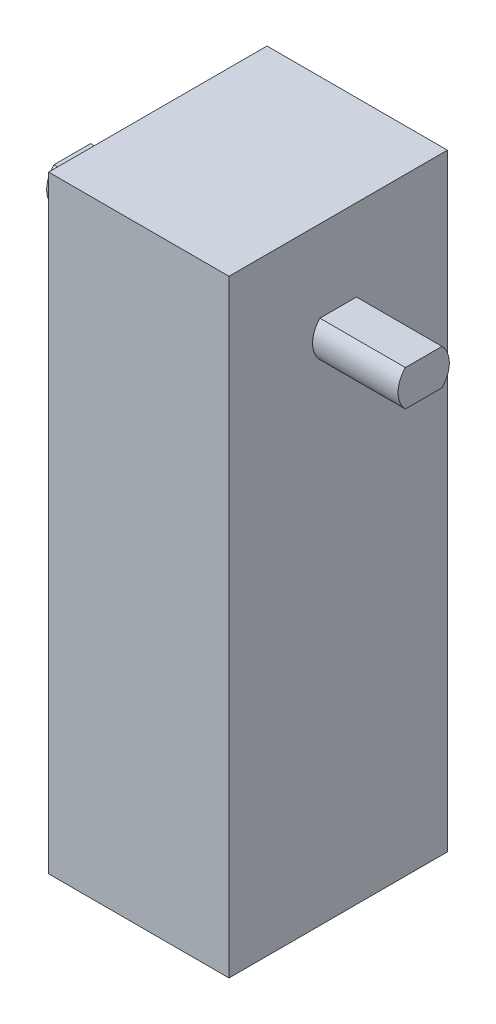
ISO-10303-21;
HEADER;
FILE_DESCRIPTION(('STEP AP214'),'2;1');
FILE_NAME('part.step','',(''),(''),'','','');
FILE_SCHEMA(('AUTOMOTIVE_DESIGN { 1 0 10303 214 1 1 1 1 }'));
ENDSEC;
DATA;
#1=APPLICATION_CONTEXT('core data for automotive mechanical design processes');
#2=APPLICATION_PROTOCOL_DEFINITION('international standard','automotive_design',2000,#1);
#3=PRODUCT_CONTEXT('',#1,'mechanical');
#4=PRODUCT('Part','Part','',(#3));
#5=PRODUCT_RELATED_PRODUCT_CATEGORY('part','',(#4));
#6=PRODUCT_DEFINITION_FORMATION('','',#4);
#7=PRODUCT_DEFINITION_CONTEXT('part definition',#1,'design');
#8=PRODUCT_DEFINITION('design','',#6,#7);
#9=PRODUCT_DEFINITION_SHAPE('','',#8);
#10=(LENGTH_UNIT() NAMED_UNIT(*) SI_UNIT(.MILLI.,.METRE.));
#11=(NAMED_UNIT(*) PLANE_ANGLE_UNIT() SI_UNIT($,.RADIAN.));
#12=(NAMED_UNIT(*) SI_UNIT($,.STERADIAN.) SOLID_ANGLE_UNIT());
#13=UNCERTAINTY_MEASURE_WITH_UNIT(LENGTH_MEASURE(1.E-05),#10,'distance_accuracy_value','');
#14=(GEOMETRIC_REPRESENTATION_CONTEXT(3) GLOBAL_UNCERTAINTY_ASSIGNED_CONTEXT((#13)) GLOBAL_UNIT_ASSIGNED_CONTEXT((#10,
#11,#12)) REPRESENTATION_CONTEXT('',''));
#15=CARTESIAN_POINT('',(0.,0.,0.));
#16=DIRECTION('',(0.,0.,1.));
#17=DIRECTION('',(1.,0.,0.));
#18=AXIS2_PLACEMENT_3D('',#15,#16,#17);
#19=CARTESIAN_POINT('',(9.29194959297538,-36.9105557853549,23.));
#20=DIRECTION('',(-1.,0.,0.));
#21=DIRECTION('',(0.,0.,1.));
#22=AXIS2_PLACEMENT_3D('',#19,#20,#21);
#23=PLANE('',#22);
#24=DIRECTION('',(0.,1.,0.));
#25=VECTOR('',#24,1.);
#26=CARTESIAN_POINT('',(9.29194959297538,-36.9105557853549,0.));
#27=LINE('',#26,#25);
#28=CARTESIAN_POINT('',(9.29194959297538,-36.9105557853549,0.));
#29=VERTEX_POINT('',#28);
#30=CARTESIAN_POINT('',(9.29194959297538,27.0894442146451,0.));
#31=VERTEX_POINT('',#30);
#32=EDGE_CURVE('E207',#29,#31,#27,.T.);
#33=ORIENTED_EDGE('',*,*,#32,.T.);
#34=DIRECTION('',(0.,0.,-1.));
#35=VECTOR('',#34,1.);
#36=CARTESIAN_POINT('',(9.29194959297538,27.0894442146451,23.));
#37=LINE('',#36,#35);
#38=CARTESIAN_POINT('',(9.29194959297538,27.0894442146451,23.));
#39=VERTEX_POINT('',#38);
#40=EDGE_CURVE('E212',#39,#31,#37,.T.);
#41=ORIENTED_EDGE('',*,*,#40,.F.);
#42=DIRECTION('',(0.,1.,0.));
#43=VECTOR('',#42,1.);
#44=CARTESIAN_POINT('',(9.29194959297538,-36.9105557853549,23.));
#45=LINE('',#44,#43);
#46=CARTESIAN_POINT('',(9.29194959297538,-36.9105557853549,23.));
#47=VERTEX_POINT('',#46);
#48=EDGE_CURVE('E198',#47,#39,#45,.T.);
#49=ORIENTED_EDGE('',*,*,#48,.F.);
#50=DIRECTION('',(0.,0.,-1.));
#51=VECTOR('',#50,1.);
#52=CARTESIAN_POINT('',(9.29194959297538,-36.9105557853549,23.));
#53=LINE('',#52,#51);
#54=EDGE_CURVE('E40',#47,#29,#53,.T.);
#55=ORIENTED_EDGE('',*,*,#54,.T.);
#56=EDGE_LOOP('',(#33,#41,#49,#55));
#57=FACE_BOUND('',#56,.T.);
#58=CARTESIAN_POINT('',(9.29194959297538,16.5894442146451,11.5));
#59=DIRECTION('',(1.,0.,0.));
#60=DIRECTION('',(0.,0.,-1.));
#61=AXIS2_PLACEMENT_3D('',#58,#59,#60);
#62=CIRCLE('',#61,2.7);
#63=CARTESIAN_POINT('',(9.29194959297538,14.6994442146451,9.57181432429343));
#64=VERTEX_POINT('',#63);
#65=CARTESIAN_POINT('',(9.29194959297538,18.4794442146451,9.57181432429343));
#66=VERTEX_POINT('',#65);
#67=EDGE_CURVE('E161',#64,#66,#62,.T.);
#68=ORIENTED_EDGE('',*,*,#67,.F.);
#69=DIRECTION('',(0.,0.,-1.));
#70=VECTOR('',#69,1.);
#71=CARTESIAN_POINT('',(9.29194959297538,14.6994442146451,13.4281856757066));
#72=LINE('',#71,#70);
#73=CARTESIAN_POINT('',(9.29194959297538,14.6994442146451,13.4281856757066));
#74=VERTEX_POINT('',#73);
#75=EDGE_CURVE('E166',#74,#64,#72,.T.);
#76=ORIENTED_EDGE('',*,*,#75,.F.);
#77=CARTESIAN_POINT('',(9.29194959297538,16.5894442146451,11.5));
#78=DIRECTION('',(1.,0.,0.));
#79=DIRECTION('',(0.,0.,-1.));
#80=AXIS2_PLACEMENT_3D('',#77,#78,#79);
#81=CIRCLE('',#80,2.7);
#82=CARTESIAN_POINT('',(9.29194959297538,18.4794442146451,13.4281856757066));
#83=VERTEX_POINT('',#82);
#84=EDGE_CURVE('E176',#83,#74,#81,.T.);
#85=ORIENTED_EDGE('',*,*,#84,.F.);
#86=DIRECTION('',(0.,0.,1.));
#87=VECTOR('',#86,1.);
#88=CARTESIAN_POINT('',(9.29194959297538,18.4794442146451,13.4281856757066));
#89=LINE('',#88,#87);
#90=EDGE_CURVE('E55',#66,#83,#89,.T.);
#91=ORIENTED_EDGE('',*,*,#90,.F.);
#92=EDGE_LOOP('',(#68,#76,#85,#91));
#93=FACE_BOUND('',#92,.T.);
#94=ADVANCED_FACE('F32',(#57,#93),#23,.F.);
#95=CARTESIAN_POINT('',(-9.70805040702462,-36.9105557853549,23.));
#96=DIRECTION('',(1.,0.,0.));
#97=DIRECTION('',(0.,1.,0.));
#98=AXIS2_PLACEMENT_3D('',#95,#96,#97);
#99=PLANE('',#98);
#100=DIRECTION('',(0.,0.,-1.));
#101=VECTOR('',#100,1.);
#102=CARTESIAN_POINT('',(-9.70805040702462,14.6994442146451,23.));
#103=LINE('',#102,#101);
#104=CARTESIAN_POINT('',(-9.70805040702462,14.6994442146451,13.4281856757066));
#105=VERTEX_POINT('',#104);
#106=CARTESIAN_POINT('',(-9.70805040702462,14.6994442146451,9.57181432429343));
#107=VERTEX_POINT('',#106);
#108=EDGE_CURVE('E156',#105,#107,#103,.T.);
#109=ORIENTED_EDGE('',*,*,#108,.T.);
#110=CARTESIAN_POINT('',(-9.70805040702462,16.5894442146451,11.5));
#111=DIRECTION('',(1.,0.,0.));
#112=DIRECTION('',(0.,1.,0.));
#113=AXIS2_PLACEMENT_3D('',#110,#111,#112);
#114=CIRCLE('',#113,2.7);
#115=CARTESIAN_POINT('',(-9.70805040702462,18.4794442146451,9.57181432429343));
#116=VERTEX_POINT('',#115);
#117=EDGE_CURVE('E159',#107,#116,#114,.T.);
#118=ORIENTED_EDGE('',*,*,#117,.T.);
#119=DIRECTION('',(0.,0.,1.));
#120=VECTOR('',#119,1.);
#121=CARTESIAN_POINT('',(-9.70805040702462,18.4794442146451,23.));
#122=LINE('',#121,#120);
#123=CARTESIAN_POINT('',(-9.70805040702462,18.4794442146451,13.4281856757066));
#124=VERTEX_POINT('',#123);
#125=EDGE_CURVE('E124',#116,#124,#122,.T.);
#126=ORIENTED_EDGE('',*,*,#125,.T.);
#127=CARTESIAN_POINT('',(-9.70805040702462,16.5894442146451,11.5));
#128=DIRECTION('',(1.,0.,0.));
#129=DIRECTION('',(0.,1.,0.));
#130=AXIS2_PLACEMENT_3D('',#127,#128,#129);
#131=CIRCLE('',#130,2.7);
#132=EDGE_CURVE('E153',#124,#105,#131,.T.);
#133=ORIENTED_EDGE('',*,*,#132,.T.);
#134=EDGE_LOOP('',(#109,#118,#126,#133));
#135=FACE_BOUND('',#134,.T.);
#136=DIRECTION('',(0.,-1.,0.));
#137=VECTOR('',#136,1.);
#138=CARTESIAN_POINT('',(-9.70805040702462,-36.9105557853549,0.));
#139=LINE('',#138,#137);
#140=CARTESIAN_POINT('',(-9.70805040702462,27.0894442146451,0.));
#141=VERTEX_POINT('',#140);
#142=CARTESIAN_POINT('',(-9.70805040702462,-36.9105557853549,0.));
#143=VERTEX_POINT('',#142);
#144=EDGE_CURVE('E191',#141,#143,#139,.T.);
#145=ORIENTED_EDGE('',*,*,#144,.T.);
#146=DIRECTION('',(0.,0.,-1.));
#147=VECTOR('',#146,1.);
#148=CARTESIAN_POINT('',(-9.70805040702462,-36.9105557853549,23.));
#149=LINE('',#148,#147);
#150=CARTESIAN_POINT('',(-9.70805040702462,-36.9105557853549,23.));
#151=VERTEX_POINT('',#150);
#152=EDGE_CURVE('E11',#151,#143,#149,.T.);
#153=ORIENTED_EDGE('',*,*,#152,.F.);
#154=DIRECTION('',(0.,-1.,0.));
#155=VECTOR('',#154,1.);
#156=CARTESIAN_POINT('',(-9.70805040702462,-36.9105557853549,23.));
#157=LINE('',#156,#155);
#158=CARTESIAN_POINT('',(-9.70805040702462,27.0894442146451,23.));
#159=VERTEX_POINT('',#158);
#160=EDGE_CURVE('E192',#159,#151,#157,.T.);
#161=ORIENTED_EDGE('',*,*,#160,.F.);
#162=DIRECTION('',(0.,0.,-1.));
#163=VECTOR('',#162,1.);
#164=CARTESIAN_POINT('',(-9.70805040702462,27.0894442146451,23.));
#165=LINE('',#164,#163);
#166=EDGE_CURVE('E202',#159,#141,#165,.T.);
#167=ORIENTED_EDGE('',*,*,#166,.T.);
#168=EDGE_LOOP('',(#145,#153,#161,#167));
#169=FACE_BOUND('',#168,.T.);
#170=ADVANCED_FACE('F34',(#135,#169),#99,.F.);
#171=CARTESIAN_POINT('',(-9.70805040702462,-36.9105557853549,23.));
#172=DIRECTION('',(0.,1.,0.));
#173=DIRECTION('',(0.,0.,1.));
#174=AXIS2_PLACEMENT_3D('',#171,#172,#173);
#175=PLANE('',#174);
#176=DIRECTION('',(1.,0.,0.));
#177=VECTOR('',#176,1.);
#178=CARTESIAN_POINT('',(-9.70805040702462,-36.9105557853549,0.));
#179=LINE('',#178,#177);
#180=EDGE_CURVE('E205',#143,#29,#179,.T.);
#181=ORIENTED_EDGE('',*,*,#180,.T.);
#182=ORIENTED_EDGE('',*,*,#54,.F.);
#183=DIRECTION('',(1.,0.,0.));
#184=VECTOR('',#183,1.);
#185=CARTESIAN_POINT('',(-9.70805040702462,-36.9105557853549,23.));
#186=LINE('',#185,#184);
#187=EDGE_CURVE('E195',#151,#47,#186,.T.);
#188=ORIENTED_EDGE('',*,*,#187,.F.);
#189=ORIENTED_EDGE('',*,*,#152,.T.);
#190=EDGE_LOOP('',(#181,#182,#188,#189));
#191=FACE_BOUND('',#190,.T.);
#192=ADVANCED_FACE('F234',(#191),#175,.F.);
#193=CARTESIAN_POINT('',(-9.70805040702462,27.0894442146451,23.));
#194=DIRECTION('',(0.,-1.,0.));
#195=DIRECTION('',(0.,0.,-1.));
#196=AXIS2_PLACEMENT_3D('',#193,#194,#195);
#197=PLANE('',#196);
#198=DIRECTION('',(-1.,0.,0.));
#199=VECTOR('',#198,1.);
#200=CARTESIAN_POINT('',(-9.70805040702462,27.0894442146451,0.));
#201=LINE('',#200,#199);
#202=EDGE_CURVE('E196',#31,#141,#201,.T.);
#203=ORIENTED_EDGE('',*,*,#202,.T.);
#204=ORIENTED_EDGE('',*,*,#166,.F.);
#205=DIRECTION('',(-1.,0.,0.));
#206=VECTOR('',#205,1.);
#207=CARTESIAN_POINT('',(-9.70805040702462,27.0894442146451,23.));
#208=LINE('',#207,#206);
#209=EDGE_CURVE('E200',#39,#159,#208,.T.);
#210=ORIENTED_EDGE('',*,*,#209,.F.);
#211=ORIENTED_EDGE('',*,*,#40,.T.);
#212=EDGE_LOOP('',(#203,#204,#210,#211));
#213=FACE_BOUND('',#212,.T.);
#214=ADVANCED_FACE('F227',(#213),#197,.F.);
#215=CARTESIAN_POINT('',(0.,0.,23.));
#216=DIRECTION('',(0.,0.,-1.));
#217=DIRECTION('',(-1.,0.,0.));
#218=AXIS2_PLACEMENT_3D('',#215,#216,#217);
#219=PLANE('',#218);
#220=ORIENTED_EDGE('',*,*,#160,.T.);
#221=ORIENTED_EDGE('',*,*,#187,.T.);
#222=ORIENTED_EDGE('',*,*,#48,.T.);
#223=ORIENTED_EDGE('',*,*,#209,.T.);
#224=EDGE_LOOP('',(#220,#221,#222,#223));
#225=FACE_BOUND('',#224,.T.);
#226=ADVANCED_FACE('F233',(#225),#219,.F.);
#227=CARTESIAN_POINT('',(0.,0.,0.));
#228=DIRECTION('',(0.,0.,-1.));
#229=DIRECTION('',(-1.,0.,0.));
#230=AXIS2_PLACEMENT_3D('',#227,#228,#229);
#231=PLANE('',#230);
#232=ORIENTED_EDGE('',*,*,#144,.F.);
#233=ORIENTED_EDGE('',*,*,#202,.F.);
#234=ORIENTED_EDGE('',*,*,#32,.F.);
#235=ORIENTED_EDGE('',*,*,#180,.F.);
#236=EDGE_LOOP('',(#232,#233,#234,#235));
#237=FACE_BOUND('',#236,.T.);
#238=ADVANCED_FACE('F224',(#237),#231,.T.);
#239=CARTESIAN_POINT('',(18.2919495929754,16.5894442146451,11.5));
#240=DIRECTION('',(-1.,0.,0.));
#241=DIRECTION('',(0.,0.,1.));
#242=AXIS2_PLACEMENT_3D('',#239,#240,#241);
#243=CYLINDRICAL_SURFACE('',#242,2.7);
#244=ORIENTED_EDGE('',*,*,#67,.T.);
#245=DIRECTION('',(-1.,0.,0.));
#246=VECTOR('',#245,1.);
#247=CARTESIAN_POINT('',(18.2919495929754,18.4794442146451,9.57181432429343));
#248=LINE('',#247,#246);
#249=CARTESIAN_POINT('',(18.2919495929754,18.4794442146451,9.57181432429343));
#250=VERTEX_POINT('',#249);
#251=EDGE_CURVE('E189',#250,#66,#248,.T.);
#252=ORIENTED_EDGE('',*,*,#251,.F.);
#253=CARTESIAN_POINT('',(18.2919495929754,16.5894442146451,11.5));
#254=DIRECTION('',(1.,0.,0.));
#255=DIRECTION('',(0.,0.,-1.));
#256=AXIS2_PLACEMENT_3D('',#253,#254,#255);
#257=CIRCLE('',#256,2.7);
#258=CARTESIAN_POINT('',(18.2919495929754,14.6994442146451,9.57181432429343));
#259=VERTEX_POINT('',#258);
#260=EDGE_CURVE('E162',#259,#250,#257,.T.);
#261=ORIENTED_EDGE('',*,*,#260,.F.);
#262=DIRECTION('',(-1.,0.,0.));
#263=VECTOR('',#262,1.);
#264=CARTESIAN_POINT('',(18.2919495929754,14.6994442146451,9.57181432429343));
#265=LINE('',#264,#263);
#266=EDGE_CURVE('E172',#259,#64,#265,.T.);
#267=ORIENTED_EDGE('',*,*,#266,.T.);
#268=EDGE_LOOP('',(#244,#252,#261,#267));
#269=FACE_BOUND('',#268,.T.);
#270=ADVANCED_FACE('F249',(#269),#243,.T.);
#271=CARTESIAN_POINT('',(18.2919495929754,18.4794442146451,13.4281856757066));
#272=DIRECTION('',(0.,-1.,0.));
#273=DIRECTION('',(0.,0.,-1.));
#274=AXIS2_PLACEMENT_3D('',#271,#272,#273);
#275=PLANE('',#274);
#276=ORIENTED_EDGE('',*,*,#90,.T.);
#277=DIRECTION('',(-1.,0.,0.));
#278=VECTOR('',#277,1.);
#279=CARTESIAN_POINT('',(18.2919495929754,18.4794442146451,13.4281856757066));
#280=LINE('',#279,#278);
#281=CARTESIAN_POINT('',(18.2919495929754,18.4794442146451,13.4281856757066));
#282=VERTEX_POINT('',#281);
#283=EDGE_CURVE('E186',#282,#83,#280,.T.);
#284=ORIENTED_EDGE('',*,*,#283,.F.);
#285=DIRECTION('',(0.,0.,1.));
#286=VECTOR('',#285,1.);
#287=CARTESIAN_POINT('',(18.2919495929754,18.4794442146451,13.4281856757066));
#288=LINE('',#287,#286);
#289=EDGE_CURVE('E165',#250,#282,#288,.T.);
#290=ORIENTED_EDGE('',*,*,#289,.F.);
#291=ORIENTED_EDGE('',*,*,#251,.T.);
#292=EDGE_LOOP('',(#276,#284,#290,#291));
#293=FACE_BOUND('',#292,.T.);
#294=ADVANCED_FACE('F254',(#293),#275,.F.);
#295=CARTESIAN_POINT('',(18.2919495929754,16.5894442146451,11.5));
#296=DIRECTION('',(-1.,0.,0.));
#297=DIRECTION('',(0.,0.,1.));
#298=AXIS2_PLACEMENT_3D('',#295,#296,#297);
#299=CYLINDRICAL_SURFACE('',#298,2.7);
#300=ORIENTED_EDGE('',*,*,#84,.T.);
#301=DIRECTION('',(-1.,0.,0.));
#302=VECTOR('',#301,1.);
#303=CARTESIAN_POINT('',(18.2919495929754,14.6994442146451,13.4281856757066));
#304=LINE('',#303,#302);
#305=CARTESIAN_POINT('',(18.2919495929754,14.6994442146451,13.4281856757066));
#306=VERTEX_POINT('',#305);
#307=EDGE_CURVE('E183',#306,#74,#304,.T.);
#308=ORIENTED_EDGE('',*,*,#307,.F.);
#309=CARTESIAN_POINT('',(18.2919495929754,16.5894442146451,11.5));
#310=DIRECTION('',(1.,0.,0.));
#311=DIRECTION('',(0.,0.,-1.));
#312=AXIS2_PLACEMENT_3D('',#309,#310,#311);
#313=CIRCLE('',#312,2.7);
#314=EDGE_CURVE('E168',#282,#306,#313,.T.);
#315=ORIENTED_EDGE('',*,*,#314,.F.);
#316=ORIENTED_EDGE('',*,*,#283,.T.);
#317=EDGE_LOOP('',(#300,#308,#315,#316));
#318=FACE_BOUND('',#317,.T.);
#319=ADVANCED_FACE('F258',(#318),#299,.T.);
#320=CARTESIAN_POINT('',(18.2919495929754,14.6994442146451,13.4281856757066));
#321=DIRECTION('',(0.,1.,0.));
#322=DIRECTION('',(0.,0.,1.));
#323=AXIS2_PLACEMENT_3D('',#320,#321,#322);
#324=PLANE('',#323);
#325=ORIENTED_EDGE('',*,*,#75,.T.);
#326=ORIENTED_EDGE('',*,*,#266,.F.);
#327=DIRECTION('',(0.,0.,-1.));
#328=VECTOR('',#327,1.);
#329=CARTESIAN_POINT('',(18.2919495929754,14.6994442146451,13.4281856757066));
#330=LINE('',#329,#328);
#331=EDGE_CURVE('E170',#306,#259,#330,.T.);
#332=ORIENTED_EDGE('',*,*,#331,.F.);
#333=ORIENTED_EDGE('',*,*,#307,.T.);
#334=EDGE_LOOP('',(#325,#326,#332,#333));
#335=FACE_BOUND('',#334,.T.);
#336=ADVANCED_FACE('F262',(#335),#324,.F.);
#337=CARTESIAN_POINT('',(18.2919495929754,16.5894442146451,11.5));
#338=DIRECTION('',(1.,0.,0.));
#339=DIRECTION('',(0.,0.,-1.));
#340=AXIS2_PLACEMENT_3D('',#337,#338,#339);
#341=PLANE('',#340);
#342=ORIENTED_EDGE('',*,*,#260,.T.);
#343=ORIENTED_EDGE('',*,*,#289,.T.);
#344=ORIENTED_EDGE('',*,*,#314,.T.);
#345=ORIENTED_EDGE('',*,*,#331,.T.);
#346=EDGE_LOOP('',(#342,#343,#344,#345));
#347=FACE_BOUND('',#346,.T.);
#348=ADVANCED_FACE('F266',(#347),#341,.T.);
#349=CARTESIAN_POINT('',(-18.7080504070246,16.5894442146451,11.5));
#350=DIRECTION('',(1.,0.,0.));
#351=DIRECTION('',(0.,1.,0.));
#352=AXIS2_PLACEMENT_3D('',#349,#350,#351);
#353=CYLINDRICAL_SURFACE('',#352,2.7);
#354=ORIENTED_EDGE('',*,*,#117,.F.);
#355=DIRECTION('',(1.,0.,0.));
#356=VECTOR('',#355,1.);
#357=CARTESIAN_POINT('',(-18.7080504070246,14.6994442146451,9.57181432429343));
#358=LINE('',#357,#356);
#359=CARTESIAN_POINT('',(-18.7080504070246,14.6994442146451,9.57181432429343));
#360=VERTEX_POINT('',#359);
#361=EDGE_CURVE('E142',#360,#107,#358,.T.);
#362=ORIENTED_EDGE('',*,*,#361,.F.);
#363=CARTESIAN_POINT('',(-18.7080504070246,16.5894442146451,11.5));
#364=DIRECTION('',(1.,0.,0.));
#365=DIRECTION('',(0.,0.,-1.));
#366=AXIS2_PLACEMENT_3D('',#363,#364,#365);
#367=CIRCLE('',#366,2.7);
#368=CARTESIAN_POINT('',(-18.7080504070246,18.4794442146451,9.57181432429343));
#369=VERTEX_POINT('',#368);
#370=EDGE_CURVE('E135',#360,#369,#367,.T.);
#371=ORIENTED_EDGE('',*,*,#370,.T.);
#372=DIRECTION('',(1.,0.,0.));
#373=VECTOR('',#372,1.);
#374=CARTESIAN_POINT('',(-18.7080504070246,18.4794442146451,9.57181432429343));
#375=LINE('',#374,#373);
#376=EDGE_CURVE('E119',#369,#116,#375,.T.);
#377=ORIENTED_EDGE('',*,*,#376,.T.);
#378=EDGE_LOOP('',(#354,#362,#371,#377));
#379=FACE_BOUND('',#378,.T.);
#380=ADVANCED_FACE('F140',(#379),#353,.T.);
#381=CARTESIAN_POINT('',(-18.7080504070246,14.6994442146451,13.4281856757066));
#382=DIRECTION('',(0.,-1.,0.));
#383=DIRECTION('',(1.,0.,0.));
#384=AXIS2_PLACEMENT_3D('',#381,#382,#383);
#385=PLANE('',#384);
#386=ORIENTED_EDGE('',*,*,#108,.F.);
#387=DIRECTION('',(1.,0.,0.));
#388=VECTOR('',#387,1.);
#389=CARTESIAN_POINT('',(-18.7080504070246,14.6994442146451,13.4281856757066));
#390=LINE('',#389,#388);
#391=CARTESIAN_POINT('',(-18.7080504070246,14.6994442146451,13.4281856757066));
#392=VERTEX_POINT('',#391);
#393=EDGE_CURVE('E148',#392,#105,#390,.T.);
#394=ORIENTED_EDGE('',*,*,#393,.F.);
#395=DIRECTION('',(0.,0.,-1.));
#396=VECTOR('',#395,1.);
#397=CARTESIAN_POINT('',(-18.7080504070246,14.6994442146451,13.4281856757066));
#398=LINE('',#397,#396);
#399=EDGE_CURVE('E128',#392,#360,#398,.T.);
#400=ORIENTED_EDGE('',*,*,#399,.T.);
#401=ORIENTED_EDGE('',*,*,#361,.T.);
#402=EDGE_LOOP('',(#386,#394,#400,#401));
#403=FACE_BOUND('',#402,.T.);
#404=ADVANCED_FACE('F273',(#403),#385,.T.);
#405=CARTESIAN_POINT('',(-18.7080504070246,16.5894442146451,11.5));
#406=DIRECTION('',(1.,0.,0.));
#407=DIRECTION('',(0.,1.,0.));
#408=AXIS2_PLACEMENT_3D('',#405,#406,#407);
#409=CYLINDRICAL_SURFACE('',#408,2.7);
#410=ORIENTED_EDGE('',*,*,#132,.F.);
#411=DIRECTION('',(1.,0.,0.));
#412=VECTOR('',#411,1.);
#413=CARTESIAN_POINT('',(-18.7080504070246,18.4794442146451,13.4281856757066));
#414=LINE('',#413,#412);
#415=CARTESIAN_POINT('',(-18.7080504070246,18.4794442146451,13.4281856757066));
#416=VERTEX_POINT('',#415);
#417=EDGE_CURVE('E47',#416,#124,#414,.T.);
#418=ORIENTED_EDGE('',*,*,#417,.F.);
#419=CARTESIAN_POINT('',(-18.7080504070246,16.5894442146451,11.5));
#420=DIRECTION('',(1.,0.,0.));
#421=DIRECTION('',(0.,0.,-1.));
#422=AXIS2_PLACEMENT_3D('',#419,#420,#421);
#423=CIRCLE('',#422,2.7);
#424=EDGE_CURVE('E138',#416,#392,#423,.T.);
#425=ORIENTED_EDGE('',*,*,#424,.T.);
#426=ORIENTED_EDGE('',*,*,#393,.T.);
#427=EDGE_LOOP('',(#410,#418,#425,#426));
#428=FACE_BOUND('',#427,.T.);
#429=ADVANCED_FACE('F276',(#428),#409,.T.);
#430=CARTESIAN_POINT('',(-18.7080504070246,18.4794442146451,13.4281856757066));
#431=DIRECTION('',(0.,1.,0.));
#432=DIRECTION('',(-1.,0.,0.));
#433=AXIS2_PLACEMENT_3D('',#430,#431,#432);
#434=PLANE('',#433);
#435=ORIENTED_EDGE('',*,*,#125,.F.);
#436=ORIENTED_EDGE('',*,*,#376,.F.);
#437=DIRECTION('',(0.,0.,1.));
#438=VECTOR('',#437,1.);
#439=CARTESIAN_POINT('',(-18.7080504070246,18.4794442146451,13.4281856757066));
#440=LINE('',#439,#438);
#441=EDGE_CURVE('E122',#369,#416,#440,.T.);
#442=ORIENTED_EDGE('',*,*,#441,.T.);
#443=ORIENTED_EDGE('',*,*,#417,.T.);
#444=EDGE_LOOP('',(#435,#436,#442,#443));
#445=FACE_BOUND('',#444,.T.);
#446=ADVANCED_FACE('F121',(#445),#434,.T.);
#447=CARTESIAN_POINT('',(-18.7080504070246,16.5894442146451,11.5));
#448=DIRECTION('',(1.,0.,0.));
#449=DIRECTION('',(0.,0.,-1.));
#450=AXIS2_PLACEMENT_3D('',#447,#448,#449);
#451=PLANE('',#450);
#452=ORIENTED_EDGE('',*,*,#370,.F.);
#453=ORIENTED_EDGE('',*,*,#399,.F.);
#454=ORIENTED_EDGE('',*,*,#424,.F.);
#455=ORIENTED_EDGE('',*,*,#441,.F.);
#456=EDGE_LOOP('',(#452,#453,#454,#455));
#457=FACE_BOUND('',#456,.T.);
#458=ADVANCED_FACE('F133',(#457),#451,.F.);
#459=CLOSED_SHELL('',(#94,#170,#192,#214,#226,#238,#270,#294,#319,#336,#348,#380,#404,#429,#446,#458));
#460=MANIFOLD_SOLID_BREP('B2',#459);
#461=ADVANCED_BREP_SHAPE_REPRESENTATION('',(#18,#460),#14);
#462=SHAPE_DEFINITION_REPRESENTATION(#9,#461);
ENDSEC;
END-ISO-10303-21;
